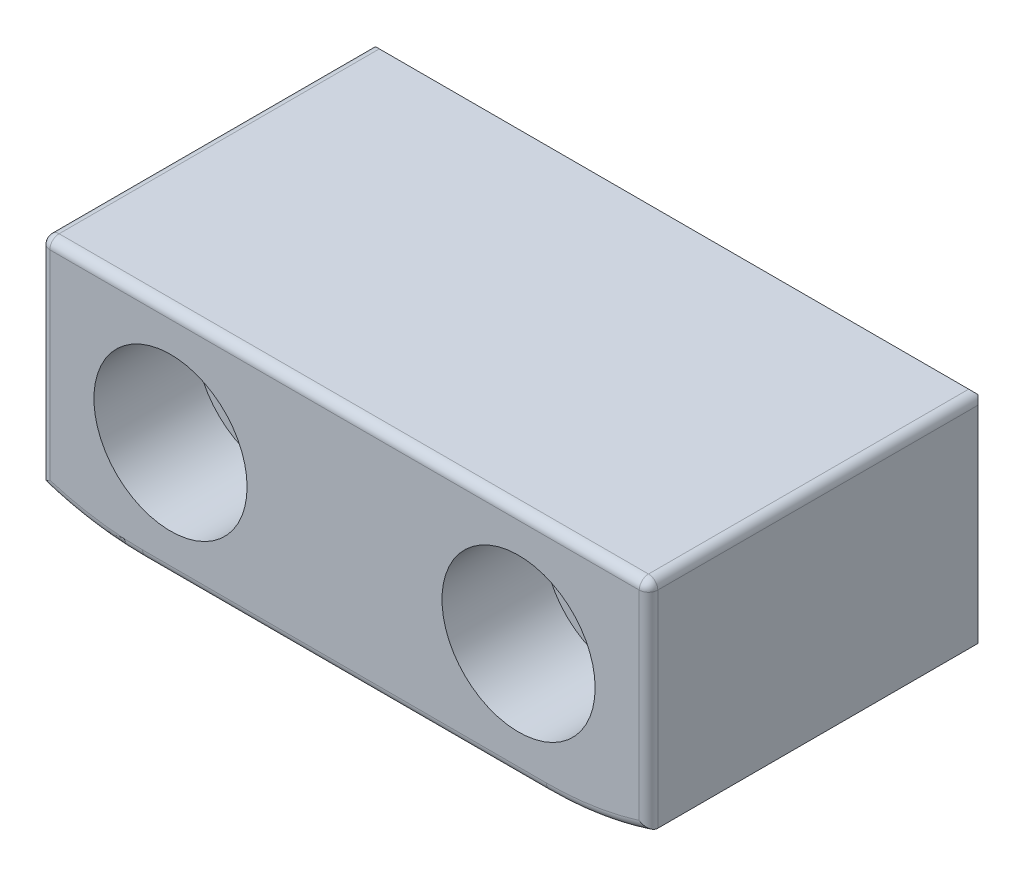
ISO-10303-21;
HEADER;
FILE_DESCRIPTION(('STEP AP214'),'2;1');
FILE_NAME('part.step','',(''),(''),'','','');
FILE_SCHEMA(('AUTOMOTIVE_DESIGN { 1 0 10303 214 1 1 1 1 }'));
ENDSEC;
DATA;
#1=APPLICATION_CONTEXT('core data for automotive mechanical design processes');
#2=APPLICATION_PROTOCOL_DEFINITION('international standard','automotive_design',2000,#1);
#3=PRODUCT_CONTEXT('',#1,'mechanical');
#4=PRODUCT('Part','Part','',(#3));
#5=PRODUCT_RELATED_PRODUCT_CATEGORY('part','',(#4));
#6=PRODUCT_DEFINITION_FORMATION('','',#4);
#7=PRODUCT_DEFINITION_CONTEXT('part definition',#1,'design');
#8=PRODUCT_DEFINITION('design','',#6,#7);
#9=PRODUCT_DEFINITION_SHAPE('','',#8);
#10=(LENGTH_UNIT() NAMED_UNIT(*) SI_UNIT(.MILLI.,.METRE.));
#11=(NAMED_UNIT(*) PLANE_ANGLE_UNIT() SI_UNIT($,.RADIAN.));
#12=(NAMED_UNIT(*) SI_UNIT($,.STERADIAN.) SOLID_ANGLE_UNIT());
#13=UNCERTAINTY_MEASURE_WITH_UNIT(LENGTH_MEASURE(1.E-05),#10,'distance_accuracy_value','');
#14=(GEOMETRIC_REPRESENTATION_CONTEXT(3) GLOBAL_UNCERTAINTY_ASSIGNED_CONTEXT((#13)) GLOBAL_UNIT_ASSIGNED_CONTEXT((#10,
#11,#12)) REPRESENTATION_CONTEXT('',''));
#15=CARTESIAN_POINT('',(0.,0.,0.));
#16=DIRECTION('',(0.,0.,1.));
#17=DIRECTION('',(1.,0.,0.));
#18=AXIS2_PLACEMENT_3D('',#15,#16,#17);
#19=CARTESIAN_POINT('',(-9.525,-6.35,-19.05));
#20=DIRECTION('',(0.,0.,1.));
#21=DIRECTION('',(1.,0.,0.));
#22=AXIS2_PLACEMENT_3D('',#19,#20,#21);
#23=CYLINDRICAL_SURFACE('',#22,2.794);
#24=CARTESIAN_POINT('',(-9.525,-6.35,-19.05));
#25=DIRECTION('',(0.,0.,1.));
#26=DIRECTION('',(1.,0.,0.));
#27=AXIS2_PLACEMENT_3D('',#24,#25,#26);
#28=CIRCLE('',#27,2.794);
#29=CARTESIAN_POINT('',(-6.731,-6.35,-19.05));
#30=VERTEX_POINT('',#29);
#31=EDGE_CURVE('E387',#30,#30,#28,.T.);
#32=CARTESIAN_POINT('',(-9.525,-6.35,-5.588));
#33=DIRECTION('',(0.,0.,1.));
#34=DIRECTION('',(1.,0.,0.));
#35=AXIS2_PLACEMENT_3D('',#32,#33,#34);
#36=CIRCLE('',#35,2.794);
#37=CARTESIAN_POINT('',(-6.731,-6.35,-5.588));
#38=VERTEX_POINT('',#37);
#39=EDGE_CURVE('E195',#38,#38,#36,.F.);
#40=CARTESIAN_POINT('',(-6.731,-6.35,-19.05));
#41=CARTESIAN_POINT('',(-6.731,-6.35,-18.9097708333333));
#42=CARTESIAN_POINT('',(-6.731,-6.35,-18.7695416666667));
#43=CARTESIAN_POINT('',(-6.731,-6.35,-18.4890833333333));
#44=CARTESIAN_POINT('',(-6.731,-6.35,-18.3488541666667));
#45=CARTESIAN_POINT('',(-6.731,-6.35,-18.0683958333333));
#46=CARTESIAN_POINT('',(-6.731,-6.35,-17.9281666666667));
#47=CARTESIAN_POINT('',(-6.731,-6.35,-17.6477083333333));
#48=CARTESIAN_POINT('',(-6.731,-6.35,-17.5074791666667));
#49=CARTESIAN_POINT('',(-6.731,-6.35,-17.2270208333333));
#50=CARTESIAN_POINT('',(-6.731,-6.35,-17.0867916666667));
#51=CARTESIAN_POINT('',(-6.731,-6.35,-16.8063333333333));
#52=CARTESIAN_POINT('',(-6.731,-6.35,-16.6661041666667));
#53=CARTESIAN_POINT('',(-6.731,-6.35,-16.3856458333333));
#54=CARTESIAN_POINT('',(-6.731,-6.35,-16.2454166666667));
#55=CARTESIAN_POINT('',(-6.731,-6.35,-15.9649583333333));
#56=CARTESIAN_POINT('',(-6.731,-6.35,-15.8247291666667));
#57=CARTESIAN_POINT('',(-6.731,-6.35,-15.5442708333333));
#58=CARTESIAN_POINT('',(-6.731,-6.35,-15.4040416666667));
#59=CARTESIAN_POINT('',(-6.731,-6.35,-15.1235833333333));
#60=CARTESIAN_POINT('',(-6.731,-6.35,-14.9833541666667));
#61=CARTESIAN_POINT('',(-6.731,-6.35,-14.7028958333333));
#62=CARTESIAN_POINT('',(-6.731,-6.35,-14.5626666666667));
#63=CARTESIAN_POINT('',(-6.731,-6.35,-14.2822083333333));
#64=CARTESIAN_POINT('',(-6.731,-6.35,-14.1419791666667));
#65=CARTESIAN_POINT('',(-6.731,-6.35,-13.8615208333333));
#66=CARTESIAN_POINT('',(-6.731,-6.35,-13.7212916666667));
#67=CARTESIAN_POINT('',(-6.731,-6.35,-13.4408333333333));
#68=CARTESIAN_POINT('',(-6.731,-6.35,-13.3006041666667));
#69=CARTESIAN_POINT('',(-6.731,-6.35,-13.0201458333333));
#70=CARTESIAN_POINT('',(-6.731,-6.35,-12.8799166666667));
#71=CARTESIAN_POINT('',(-6.731,-6.35,-12.5994583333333));
#72=CARTESIAN_POINT('',(-6.731,-6.35,-12.4592291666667));
#73=CARTESIAN_POINT('',(-6.731,-6.35,-12.1787708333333));
#74=CARTESIAN_POINT('',(-6.731,-6.35,-12.0385416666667));
#75=CARTESIAN_POINT('',(-6.731,-6.35,-11.7580833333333));
#76=CARTESIAN_POINT('',(-6.731,-6.35,-11.6178541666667));
#77=CARTESIAN_POINT('',(-6.731,-6.35,-11.3373958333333));
#78=CARTESIAN_POINT('',(-6.731,-6.35,-11.1971666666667));
#79=CARTESIAN_POINT('',(-6.731,-6.35,-10.9167083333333));
#80=CARTESIAN_POINT('',(-6.731,-6.35,-10.7764791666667));
#81=CARTESIAN_POINT('',(-6.731,-6.35,-10.4960208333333));
#82=CARTESIAN_POINT('',(-6.731,-6.35,-10.3557916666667));
#83=CARTESIAN_POINT('',(-6.731,-6.35,-10.0753333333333));
#84=CARTESIAN_POINT('',(-6.731,-6.35,-9.93510416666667));
#85=CARTESIAN_POINT('',(-6.731,-6.35,-9.65464583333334));
#86=CARTESIAN_POINT('',(-6.731,-6.35,-9.51441666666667));
#87=CARTESIAN_POINT('',(-6.731,-6.35,-9.23395833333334));
#88=CARTESIAN_POINT('',(-6.731,-6.35,-9.09372916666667));
#89=CARTESIAN_POINT('',(-6.731,-6.35,-8.81327083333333));
#90=CARTESIAN_POINT('',(-6.731,-6.35,-8.67304166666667));
#91=CARTESIAN_POINT('',(-6.731,-6.35,-8.39258333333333));
#92=CARTESIAN_POINT('',(-6.731,-6.35,-8.25235416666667));
#93=CARTESIAN_POINT('',(-6.731,-6.35,-7.97189583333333));
#94=CARTESIAN_POINT('',(-6.731,-6.35,-7.83166666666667));
#95=CARTESIAN_POINT('',(-6.731,-6.35,-7.55120833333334));
#96=CARTESIAN_POINT('',(-6.731,-6.35,-7.41097916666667));
#97=CARTESIAN_POINT('',(-6.731,-6.35,-7.13052083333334));
#98=CARTESIAN_POINT('',(-6.731,-6.35,-6.99029166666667));
#99=CARTESIAN_POINT('',(-6.731,-6.35,-6.70983333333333));
#100=CARTESIAN_POINT('',(-6.731,-6.35,-6.56960416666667));
#101=CARTESIAN_POINT('',(-6.731,-6.35,-6.28914583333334));
#102=CARTESIAN_POINT('',(-6.731,-6.35,-6.14891666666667));
#103=CARTESIAN_POINT('',(-6.731,-6.35,-5.86845833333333));
#104=CARTESIAN_POINT('',(-6.731,-6.35,-5.72822916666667));
#105=CARTESIAN_POINT('',(-6.731,-6.35,-5.588));
#106=B_SPLINE_CURVE_WITH_KNOTS('',3,(#40,#41,#42,#43,#44,#45,#46,#47,#48,#49,#50,#51,#52,#53,
#54,#55,#56,#57,#58,#59,#60,#61,#62,#63,#64,#65,#66,#67,#68,#69,#70,#71,#72,#73,#74,#75,#76,#77,
#78,#79,#80,#81,#82,#83,#84,#85,#86,#87,#88,#89,#90,#91,#92,#93,#94,#95,#96,#97,#98,#99,#100,
#101,#102,#103,#104,#105),.UNSPECIFIED.,.F.,.F.,(4,2,2,2,2,2,2,2,2,2,2,2,2,2,2,2,2,2,2,2,2,2,2,
2,2,2,2,2,2,2,2,2,4),(0.,0.420687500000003,0.841375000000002,1.2620625,1.68275,2.1034375,
2.524125,2.9448125,3.3655,3.7861875,4.206875,4.6275625,5.04825,5.4689375,5.889625,6.3103125,
6.731,7.1516875,7.572375,7.9930625,8.41375,8.8344375,9.255125,9.6758125,10.0965,10.5171875,
10.937875,11.3585625,11.77925,12.1999375,12.620625,13.0413125,13.462),.UNSPECIFIED.);
#107=EDGE_CURVE('BSEAM37',#30,#38,#106,.T.);
#108=ORIENTED_EDGE('',*,*,#31,.F.);
#109=ORIENTED_EDGE('',*,*,#39,.F.);
#110=ORIENTED_EDGE('',*,*,#107,.T.);
#111=ORIENTED_EDGE('',*,*,#107,.F.);
#112=EDGE_LOOP('',(#108,#110,#109,#111));
#113=FACE_BOUND('',#112,.T.);
#114=ADVANCED_FACE('F37',(#113),#23,.F.);
#115=CARTESIAN_POINT('',(9.525,-6.35,-19.05));
#116=DIRECTION('',(0.,0.,1.));
#117=DIRECTION('',(1.,0.,0.));
#118=AXIS2_PLACEMENT_3D('',#115,#116,#117);
#119=CYLINDRICAL_SURFACE('',#118,2.794);
#120=CARTESIAN_POINT('',(9.525,-6.35,-19.05));
#121=DIRECTION('',(0.,0.,1.));
#122=DIRECTION('',(1.,0.,0.));
#123=AXIS2_PLACEMENT_3D('',#120,#121,#122);
#124=CIRCLE('',#123,2.794);
#125=CARTESIAN_POINT('',(12.319,-6.35,-19.05));
#126=VERTEX_POINT('',#125);
#127=EDGE_CURVE('E384',#126,#126,#124,.T.);
#128=CARTESIAN_POINT('',(9.525,-6.35,-5.588));
#129=DIRECTION('',(0.,0.,1.));
#130=DIRECTION('',(1.,0.,0.));
#131=AXIS2_PLACEMENT_3D('',#128,#129,#130);
#132=CIRCLE('',#131,2.794);
#133=CARTESIAN_POINT('',(12.319,-6.35,-5.588));
#134=VERTEX_POINT('',#133);
#135=EDGE_CURVE('E385',#134,#134,#132,.F.);
#136=CARTESIAN_POINT('',(12.319,-6.35,-19.05));
#137=CARTESIAN_POINT('',(12.319,-6.35,-18.9097708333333));
#138=CARTESIAN_POINT('',(12.319,-6.35,-18.7695416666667));
#139=CARTESIAN_POINT('',(12.319,-6.35,-18.4890833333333));
#140=CARTESIAN_POINT('',(12.319,-6.35,-18.3488541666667));
#141=CARTESIAN_POINT('',(12.319,-6.35,-18.0683958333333));
#142=CARTESIAN_POINT('',(12.319,-6.35,-17.9281666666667));
#143=CARTESIAN_POINT('',(12.319,-6.35,-17.6477083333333));
#144=CARTESIAN_POINT('',(12.319,-6.35,-17.5074791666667));
#145=CARTESIAN_POINT('',(12.319,-6.35,-17.2270208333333));
#146=CARTESIAN_POINT('',(12.319,-6.35,-17.0867916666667));
#147=CARTESIAN_POINT('',(12.319,-6.35,-16.8063333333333));
#148=CARTESIAN_POINT('',(12.319,-6.35,-16.6661041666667));
#149=CARTESIAN_POINT('',(12.319,-6.35,-16.3856458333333));
#150=CARTESIAN_POINT('',(12.319,-6.35,-16.2454166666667));
#151=CARTESIAN_POINT('',(12.319,-6.35,-15.9649583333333));
#152=CARTESIAN_POINT('',(12.319,-6.35,-15.8247291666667));
#153=CARTESIAN_POINT('',(12.319,-6.35,-15.5442708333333));
#154=CARTESIAN_POINT('',(12.319,-6.35,-15.4040416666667));
#155=CARTESIAN_POINT('',(12.319,-6.35,-15.1235833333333));
#156=CARTESIAN_POINT('',(12.319,-6.35,-14.9833541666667));
#157=CARTESIAN_POINT('',(12.319,-6.35,-14.7028958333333));
#158=CARTESIAN_POINT('',(12.319,-6.35,-14.5626666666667));
#159=CARTESIAN_POINT('',(12.319,-6.35,-14.2822083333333));
#160=CARTESIAN_POINT('',(12.319,-6.35,-14.1419791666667));
#161=CARTESIAN_POINT('',(12.319,-6.35,-13.8615208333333));
#162=CARTESIAN_POINT('',(12.319,-6.35,-13.7212916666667));
#163=CARTESIAN_POINT('',(12.319,-6.35,-13.4408333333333));
#164=CARTESIAN_POINT('',(12.319,-6.35,-13.3006041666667));
#165=CARTESIAN_POINT('',(12.319,-6.35,-13.0201458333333));
#166=CARTESIAN_POINT('',(12.319,-6.35,-12.8799166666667));
#167=CARTESIAN_POINT('',(12.319,-6.35,-12.5994583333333));
#168=CARTESIAN_POINT('',(12.319,-6.35,-12.4592291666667));
#169=CARTESIAN_POINT('',(12.319,-6.35,-12.1787708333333));
#170=CARTESIAN_POINT('',(12.319,-6.35,-12.0385416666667));
#171=CARTESIAN_POINT('',(12.319,-6.35,-11.7580833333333));
#172=CARTESIAN_POINT('',(12.319,-6.35,-11.6178541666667));
#173=CARTESIAN_POINT('',(12.319,-6.35,-11.3373958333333));
#174=CARTESIAN_POINT('',(12.319,-6.35,-11.1971666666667));
#175=CARTESIAN_POINT('',(12.319,-6.35,-10.9167083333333));
#176=CARTESIAN_POINT('',(12.319,-6.35,-10.7764791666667));
#177=CARTESIAN_POINT('',(12.319,-6.35,-10.4960208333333));
#178=CARTESIAN_POINT('',(12.319,-6.35,-10.3557916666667));
#179=CARTESIAN_POINT('',(12.319,-6.35,-10.0753333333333));
#180=CARTESIAN_POINT('',(12.319,-6.35,-9.93510416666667));
#181=CARTESIAN_POINT('',(12.319,-6.35,-9.65464583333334));
#182=CARTESIAN_POINT('',(12.319,-6.35,-9.51441666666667));
#183=CARTESIAN_POINT('',(12.319,-6.35,-9.23395833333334));
#184=CARTESIAN_POINT('',(12.319,-6.35,-9.09372916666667));
#185=CARTESIAN_POINT('',(12.319,-6.35,-8.81327083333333));
#186=CARTESIAN_POINT('',(12.319,-6.35,-8.67304166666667));
#187=CARTESIAN_POINT('',(12.319,-6.35,-8.39258333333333));
#188=CARTESIAN_POINT('',(12.319,-6.35,-8.25235416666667));
#189=CARTESIAN_POINT('',(12.319,-6.35,-7.97189583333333));
#190=CARTESIAN_POINT('',(12.319,-6.35,-7.83166666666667));
#191=CARTESIAN_POINT('',(12.319,-6.35,-7.55120833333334));
#192=CARTESIAN_POINT('',(12.319,-6.35,-7.41097916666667));
#193=CARTESIAN_POINT('',(12.319,-6.35,-7.13052083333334));
#194=CARTESIAN_POINT('',(12.319,-6.35,-6.99029166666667));
#195=CARTESIAN_POINT('',(12.319,-6.35,-6.70983333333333));
#196=CARTESIAN_POINT('',(12.319,-6.35,-6.56960416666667));
#197=CARTESIAN_POINT('',(12.319,-6.35,-6.28914583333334));
#198=CARTESIAN_POINT('',(12.319,-6.35,-6.14891666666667));
#199=CARTESIAN_POINT('',(12.319,-6.35,-5.86845833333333));
#200=CARTESIAN_POINT('',(12.319,-6.35,-5.72822916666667));
#201=CARTESIAN_POINT('',(12.319,-6.35,-5.588));
#202=B_SPLINE_CURVE_WITH_KNOTS('',3,(#136,#137,#138,#139,#140,#141,#142,#143,#144,#145,#146,
#147,#148,#149,#150,#151,#152,#153,#154,#155,#156,#157,#158,#159,#160,#161,#162,#163,#164,#165,
#166,#167,#168,#169,#170,#171,#172,#173,#174,#175,#176,#177,#178,#179,#180,#181,#182,#183,#184,
#185,#186,#187,#188,#189,#190,#191,#192,#193,#194,#195,#196,#197,#198,#199,#200,#201),
.UNSPECIFIED.,.F.,.F.,(4,2,2,2,2,2,2,2,2,2,2,2,2,2,2,2,2,2,2,2,2,2,2,2,2,2,2,2,2,2,2,2,4),(0.,
0.420687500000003,0.841375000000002,1.2620625,1.68275,2.1034375,2.524125,2.9448125,3.3655,
3.7861875,4.206875,4.6275625,5.04825,5.4689375,5.889625,6.3103125,6.731,7.1516875,7.572375,
7.9930625,8.41375,8.8344375,9.255125,9.6758125,10.0965,10.5171875,10.937875,11.3585625,11.77925,
12.1999375,12.620625,13.0413125,13.462),.UNSPECIFIED.);
#203=EDGE_CURVE('BSEAM407',#126,#134,#202,.T.);
#204=ORIENTED_EDGE('',*,*,#127,.F.);
#205=ORIENTED_EDGE('',*,*,#135,.F.);
#206=ORIENTED_EDGE('',*,*,#203,.T.);
#207=ORIENTED_EDGE('',*,*,#203,.F.);
#208=EDGE_LOOP('',(#204,#206,#205,#207));
#209=FACE_BOUND('',#208,.T.);
#210=ADVANCED_FACE('F407',(#209),#119,.F.);
#211=CARTESIAN_POINT('',(-11.049,5.08,-19.05));
#212=DIRECTION('',(0.,0.,1.));
#213=DIRECTION('',(1.,0.,0.));
#214=AXIS2_PLACEMENT_3D('',#211,#212,#213);
#215=CYLINDRICAL_SURFACE('',#214,17.78);
#216=DIRECTION('',(0.,0.,1.));
#217=VECTOR('',#216,1.);
#218=CARTESIAN_POINT('',(-11.049,-12.7,-19.05));
#219=LINE('',#218,#217);
#220=CARTESIAN_POINT('',(-11.049,-12.7,-18.034));
#221=VERTEX_POINT('',#220);
#222=CARTESIAN_POINT('',(-11.049,-12.7,-0.508000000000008));
#223=VERTEX_POINT('',#222);
#224=EDGE_CURVE('E155',#221,#223,#219,.T.);
#225=ORIENTED_EDGE('',*,*,#224,.T.);
#226=CARTESIAN_POINT('',(-11.049,5.08,-0.508000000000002));
#227=DIRECTION('',(0.,0.,-1.));
#228=DIRECTION('',(-1.,0.,0.));
#229=AXIS2_PLACEMENT_3D('',#226,#227,#228);
#230=CIRCLE('',#229,17.78);
#231=CARTESIAN_POINT('',(-16.637,-11.7990596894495,-0.508000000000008));
#232=VERTEX_POINT('',#231);
#233=EDGE_CURVE('E265',#223,#232,#230,.T.);
#234=ORIENTED_EDGE('',*,*,#233,.T.);
#235=DIRECTION('',(0.,0.,1.));
#236=VECTOR('',#235,1.);
#237=CARTESIAN_POINT('',(-16.637,-11.7990596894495,-19.05));
#238=LINE('',#237,#236);
#239=CARTESIAN_POINT('',(-16.637,-11.7990596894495,-18.034));
#240=VERTEX_POINT('',#239);
#241=EDGE_CURVE('E188',#240,#232,#238,.T.);
#242=ORIENTED_EDGE('',*,*,#241,.F.);
#243=CARTESIAN_POINT('',(-11.049,5.08,-18.034));
#244=DIRECTION('',(0.,0.,-1.));
#245=DIRECTION('',(-1.,0.,0.));
#246=AXIS2_PLACEMENT_3D('',#243,#244,#245);
#247=CIRCLE('',#246,17.78);
#248=EDGE_CURVE('E207',#240,#221,#247,.F.);
#249=ORIENTED_EDGE('',*,*,#248,.T.);
#250=EDGE_LOOP('',(#225,#234,#242,#249));
#251=FACE_BOUND('',#250,.T.);
#252=ADVANCED_FACE('F410',(#251),#215,.T.);
#253=CARTESIAN_POINT('',(-16.637,-11.7990596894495,-19.05));
#254=DIRECTION('',(-1.,0.,0.));
#255=DIRECTION('',(0.,0.,1.));
#256=AXIS2_PLACEMENT_3D('',#253,#254,#255);
#257=PLANE('',#256);
#258=ORIENTED_EDGE('',*,*,#241,.T.);
#259=DIRECTION('',(0.,-1.,0.));
#260=VECTOR('',#259,1.);
#261=CARTESIAN_POINT('',(-16.637,0.,-0.508));
#262=LINE('',#261,#260);
#263=CARTESIAN_POINT('',(-16.637,-0.508,-0.508));
#264=VERTEX_POINT('',#263);
#265=EDGE_CURVE('E271',#232,#264,#262,.F.);
#266=ORIENTED_EDGE('',*,*,#265,.T.);
#267=DIRECTION('',(0.,0.,1.));
#268=VECTOR('',#267,1.);
#269=CARTESIAN_POINT('',(-16.637,-0.508,-19.05));
#270=LINE('',#269,#268);
#271=CARTESIAN_POINT('',(-16.637,-0.508,-18.034));
#272=VERTEX_POINT('',#271);
#273=EDGE_CURVE('E269',#264,#272,#270,.F.);
#274=ORIENTED_EDGE('',*,*,#273,.T.);
#275=DIRECTION('',(0.,-1.,0.));
#276=VECTOR('',#275,1.);
#277=CARTESIAN_POINT('',(-16.637,-11.7990596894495,-18.034));
#278=LINE('',#277,#276);
#279=EDGE_CURVE('E209',#272,#240,#278,.T.);
#280=ORIENTED_EDGE('',*,*,#279,.T.);
#281=EDGE_LOOP('',(#258,#266,#274,#280));
#282=FACE_BOUND('',#281,.T.);
#283=ADVANCED_FACE('F416',(#282),#257,.T.);
#284=CARTESIAN_POINT('',(-16.637,0.,-19.05));
#285=DIRECTION('',(0.,1.,0.));
#286=DIRECTION('',(-1.,0.,0.));
#287=AXIS2_PLACEMENT_3D('',#284,#285,#286);
#288=PLANE('',#287);
#289=DIRECTION('',(-1.,0.,0.));
#290=VECTOR('',#289,1.);
#291=CARTESIAN_POINT('',(16.637,0.,-0.508));
#292=LINE('',#291,#290);
#293=CARTESIAN_POINT('',(-16.129,0.,-0.508));
#294=VERTEX_POINT('',#293);
#295=CARTESIAN_POINT('',(16.129,0.,-0.508));
#296=VERTEX_POINT('',#295);
#297=EDGE_CURVE('E279',#294,#296,#292,.F.);
#298=ORIENTED_EDGE('',*,*,#297,.T.);
#299=DIRECTION('',(0.,0.,1.));
#300=VECTOR('',#299,1.);
#301=CARTESIAN_POINT('',(16.129,0.,-19.05));
#302=LINE('',#301,#300);
#303=CARTESIAN_POINT('',(16.129,0.,-18.034));
#304=VERTEX_POINT('',#303);
#305=EDGE_CURVE('E283',#296,#304,#302,.F.);
#306=ORIENTED_EDGE('',*,*,#305,.T.);
#307=DIRECTION('',(-1.,0.,0.));
#308=VECTOR('',#307,1.);
#309=CARTESIAN_POINT('',(-16.637,0.,-18.034));
#310=LINE('',#309,#308);
#311=CARTESIAN_POINT('',(-16.129,0.,-18.034));
#312=VERTEX_POINT('',#311);
#313=EDGE_CURVE('E211',#304,#312,#310,.T.);
#314=ORIENTED_EDGE('',*,*,#313,.T.);
#315=DIRECTION('',(0.,0.,1.));
#316=VECTOR('',#315,1.);
#317=CARTESIAN_POINT('',(-16.129,0.,-19.05));
#318=LINE('',#317,#316);
#319=EDGE_CURVE('E281',#312,#294,#318,.T.);
#320=ORIENTED_EDGE('',*,*,#319,.T.);
#321=EDGE_LOOP('',(#298,#306,#314,#320));
#322=FACE_BOUND('',#321,.T.);
#323=ADVANCED_FACE('F354',(#322),#288,.T.);
#324=CARTESIAN_POINT('',(16.637,-11.7990596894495,-19.05));
#325=DIRECTION('',(1.,0.,0.));
#326=DIRECTION('',(0.,1.,0.));
#327=AXIS2_PLACEMENT_3D('',#324,#325,#326);
#328=PLANE('',#327);
#329=DIRECTION('',(0.,1.,0.));
#330=VECTOR('',#329,1.);
#331=CARTESIAN_POINT('',(16.637,-11.7990596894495,-18.034));
#332=LINE('',#331,#330);
#333=CARTESIAN_POINT('',(16.637,-11.7990596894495,-18.034));
#334=VERTEX_POINT('',#333);
#335=CARTESIAN_POINT('',(16.637,-0.507999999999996,-18.034));
#336=VERTEX_POINT('',#335);
#337=EDGE_CURVE('E160',#334,#336,#332,.T.);
#338=ORIENTED_EDGE('',*,*,#337,.T.);
#339=DIRECTION('',(0.,0.,1.));
#340=VECTOR('',#339,1.);
#341=CARTESIAN_POINT('',(16.637,-0.507999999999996,-19.05));
#342=LINE('',#341,#340);
#343=CARTESIAN_POINT('',(16.637,-0.507999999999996,-0.508));
#344=VERTEX_POINT('',#343);
#345=EDGE_CURVE('E277',#336,#344,#342,.T.);
#346=ORIENTED_EDGE('',*,*,#345,.T.);
#347=DIRECTION('',(0.,1.,0.));
#348=VECTOR('',#347,1.);
#349=CARTESIAN_POINT('',(16.637,-11.7990596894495,-0.508));
#350=LINE('',#349,#348);
#351=CARTESIAN_POINT('',(16.637,-11.7990596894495,-0.508000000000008));
#352=VERTEX_POINT('',#351);
#353=EDGE_CURVE('E275',#344,#352,#350,.F.);
#354=ORIENTED_EDGE('',*,*,#353,.T.);
#355=DIRECTION('',(0.,0.,1.));
#356=VECTOR('',#355,1.);
#357=CARTESIAN_POINT('',(16.637,-11.7990596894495,-19.05));
#358=LINE('',#357,#356);
#359=EDGE_CURVE('E172',#334,#352,#358,.T.);
#360=ORIENTED_EDGE('',*,*,#359,.F.);
#361=EDGE_LOOP('',(#338,#346,#354,#360));
#362=FACE_BOUND('',#361,.T.);
#363=ADVANCED_FACE('F380',(#362),#328,.T.);
#364=CARTESIAN_POINT('',(11.049,5.08,-19.05));
#365=DIRECTION('',(0.,0.,1.));
#366=DIRECTION('',(1.,0.,0.));
#367=AXIS2_PLACEMENT_3D('',#364,#365,#366);
#368=CYLINDRICAL_SURFACE('',#367,17.78);
#369=ORIENTED_EDGE('',*,*,#359,.T.);
#370=CARTESIAN_POINT('',(11.049,5.08,-0.508000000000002));
#371=DIRECTION('',(0.,0.,-1.));
#372=DIRECTION('',(-1.,0.,0.));
#373=AXIS2_PLACEMENT_3D('',#370,#371,#372);
#374=CIRCLE('',#373,17.78);
#375=CARTESIAN_POINT('',(11.049,-12.7,-0.508000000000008));
#376=VERTEX_POINT('',#375);
#377=EDGE_CURVE('E171',#352,#376,#374,.T.);
#378=ORIENTED_EDGE('',*,*,#377,.T.);
#379=DIRECTION('',(0.,0.,1.));
#380=VECTOR('',#379,1.);
#381=CARTESIAN_POINT('',(11.049,-12.7,-19.05));
#382=LINE('',#381,#380);
#383=CARTESIAN_POINT('',(11.049,-12.7,-18.034));
#384=VERTEX_POINT('',#383);
#385=EDGE_CURVE('E152',#384,#376,#382,.T.);
#386=ORIENTED_EDGE('',*,*,#385,.F.);
#387=CARTESIAN_POINT('',(11.049,5.08,-18.034));
#388=DIRECTION('',(0.,0.,-1.));
#389=DIRECTION('',(-1.,0.,0.));
#390=AXIS2_PLACEMENT_3D('',#387,#388,#389);
#391=CIRCLE('',#390,17.78);
#392=EDGE_CURVE('E168',#384,#334,#391,.F.);
#393=ORIENTED_EDGE('',*,*,#392,.T.);
#394=EDGE_LOOP('',(#369,#378,#386,#393));
#395=FACE_BOUND('',#394,.T.);
#396=ADVANCED_FACE('F166',(#395),#368,.T.);
#397=CARTESIAN_POINT('',(-11.049,-12.7,-19.05));
#398=DIRECTION('',(0.,-1.,0.));
#399=DIRECTION('',(1.,0.,0.));
#400=AXIS2_PLACEMENT_3D('',#397,#398,#399);
#401=PLANE('',#400);
#402=ORIENTED_EDGE('',*,*,#385,.T.);
#403=DIRECTION('',(1.,0.,0.));
#404=VECTOR('',#403,1.);
#405=CARTESIAN_POINT('',(-11.049,-12.7,-0.508));
#406=LINE('',#405,#404);
#407=EDGE_CURVE('E273',#376,#223,#406,.F.);
#408=ORIENTED_EDGE('',*,*,#407,.T.);
#409=ORIENTED_EDGE('',*,*,#224,.F.);
#410=DIRECTION('',(1.,0.,0.));
#411=VECTOR('',#410,1.);
#412=CARTESIAN_POINT('',(-11.049,-12.7,-18.034));
#413=LINE('',#412,#411);
#414=EDGE_CURVE('E149',#221,#384,#413,.T.);
#415=ORIENTED_EDGE('',*,*,#414,.T.);
#416=EDGE_LOOP('',(#402,#408,#409,#415));
#417=FACE_BOUND('',#416,.T.);
#418=ADVANCED_FACE('F151',(#417),#401,.T.);
#419=CARTESIAN_POINT('',(-11.049,5.08,-19.05));
#420=DIRECTION('',(0.,0.,-1.));
#421=DIRECTION('',(-1.,0.,0.));
#422=AXIS2_PLACEMENT_3D('',#419,#420,#421);
#423=PLANE('',#422);
#424=DIRECTION('',(0.,-1.,0.));
#425=VECTOR('',#424,1.);
#426=CARTESIAN_POINT('',(15.621,5.08000000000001,-19.05));
#427=LINE('',#426,#425);
#428=CARTESIAN_POINT('',(15.621,-1.016,-19.05));
#429=VERTEX_POINT('',#428);
#430=CARTESIAN_POINT('',(15.621,-11.0484999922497,-19.05));
#431=VERTEX_POINT('',#430);
#432=EDGE_CURVE('E201',#429,#431,#427,.T.);
#433=ORIENTED_EDGE('',*,*,#432,.T.);
#434=CARTESIAN_POINT('',(11.049,5.08,-19.05));
#435=DIRECTION('',(0.,0.,-1.));
#436=DIRECTION('',(-1.,0.,0.));
#437=AXIS2_PLACEMENT_3D('',#434,#435,#436);
#438=CIRCLE('',#437,16.764);
#439=CARTESIAN_POINT('',(11.049,-11.684,-19.05));
#440=VERTEX_POINT('',#439);
#441=EDGE_CURVE('E161',#431,#440,#438,.T.);
#442=ORIENTED_EDGE('',*,*,#441,.T.);
#443=DIRECTION('',(-1.,0.,0.));
#444=VECTOR('',#443,1.);
#445=CARTESIAN_POINT('',(-11.049,-11.684,-19.05));
#446=LINE('',#445,#444);
#447=CARTESIAN_POINT('',(-11.049,-11.684,-19.05));
#448=VERTEX_POINT('',#447);
#449=EDGE_CURVE('E177',#440,#448,#446,.T.);
#450=ORIENTED_EDGE('',*,*,#449,.T.);
#451=CARTESIAN_POINT('',(-11.049,5.08,-19.05));
#452=DIRECTION('',(0.,0.,-1.));
#453=DIRECTION('',(-1.,0.,0.));
#454=AXIS2_PLACEMENT_3D('',#451,#452,#453);
#455=CIRCLE('',#454,16.764);
#456=CARTESIAN_POINT('',(-15.621,-11.0484999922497,-19.05));
#457=VERTEX_POINT('',#456);
#458=EDGE_CURVE('E199',#448,#457,#455,.T.);
#459=ORIENTED_EDGE('',*,*,#458,.T.);
#460=DIRECTION('',(0.,1.,0.));
#461=VECTOR('',#460,1.);
#462=CARTESIAN_POINT('',(-15.621,5.08,-19.05));
#463=LINE('',#462,#461);
#464=CARTESIAN_POINT('',(-15.621,-1.016,-19.05));
#465=VERTEX_POINT('',#464);
#466=EDGE_CURVE('E190',#457,#465,#463,.T.);
#467=ORIENTED_EDGE('',*,*,#466,.T.);
#468=DIRECTION('',(1.,0.,0.));
#469=VECTOR('',#468,1.);
#470=CARTESIAN_POINT('',(-11.049,-1.016,-19.05));
#471=LINE('',#470,#469);
#472=EDGE_CURVE('E187',#465,#429,#471,.T.);
#473=ORIENTED_EDGE('',*,*,#472,.T.);
#474=EDGE_LOOP('',(#433,#442,#450,#459,#467,#473));
#475=FACE_BOUND('',#474,.T.);
#476=ORIENTED_EDGE('',*,*,#31,.T.);
#477=EDGE_LOOP('',(#476));
#478=FACE_BOUND('',#477,.T.);
#479=ORIENTED_EDGE('',*,*,#127,.T.);
#480=EDGE_LOOP('',(#479));
#481=FACE_BOUND('',#480,.T.);
#482=ADVANCED_FACE('F405',(#475,#478,#481),#423,.T.);
#483=CARTESIAN_POINT('',(-11.049,5.08,0.));
#484=DIRECTION('',(0.,0.,-1.));
#485=DIRECTION('',(-1.,0.,0.));
#486=AXIS2_PLACEMENT_3D('',#483,#484,#485);
#487=PLANE('',#486);
#488=CARTESIAN_POINT('',(-11.049,5.08,0.));
#489=DIRECTION('',(0.,0.,-1.));
#490=DIRECTION('',(-1.,0.,0.));
#491=AXIS2_PLACEMENT_3D('',#488,#489,#490);
#492=CIRCLE('',#491,17.272);
#493=CARTESIAN_POINT('',(-16.129,-11.4280460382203,0.));
#494=VERTEX_POINT('',#493);
#495=CARTESIAN_POINT('',(-11.049,-12.192,0.));
#496=VERTEX_POINT('',#495);
#497=EDGE_CURVE('E260',#494,#496,#492,.F.);
#498=ORIENTED_EDGE('',*,*,#497,.T.);
#499=DIRECTION('',(1.,0.,0.));
#500=VECTOR('',#499,1.);
#501=CARTESIAN_POINT('',(11.049,-12.192,0.));
#502=LINE('',#501,#500);
#503=CARTESIAN_POINT('',(11.049,-12.192,0.));
#504=VERTEX_POINT('',#503);
#505=EDGE_CURVE('E263',#496,#504,#502,.T.);
#506=ORIENTED_EDGE('',*,*,#505,.T.);
#507=CARTESIAN_POINT('',(11.049,5.08,0.));
#508=DIRECTION('',(0.,0.,-1.));
#509=DIRECTION('',(-1.,0.,0.));
#510=AXIS2_PLACEMENT_3D('',#507,#508,#509);
#511=CIRCLE('',#510,17.272);
#512=CARTESIAN_POINT('',(16.129,-11.4280460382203,0.));
#513=VERTEX_POINT('',#512);
#514=EDGE_CURVE('E258',#504,#513,#511,.F.);
#515=ORIENTED_EDGE('',*,*,#514,.T.);
#516=DIRECTION('',(0.,1.,0.));
#517=VECTOR('',#516,1.);
#518=CARTESIAN_POINT('',(16.129,0.,0.));
#519=LINE('',#518,#517);
#520=CARTESIAN_POINT('',(16.129,-0.507999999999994,0.));
#521=VERTEX_POINT('',#520);
#522=EDGE_CURVE('E254',#513,#521,#519,.T.);
#523=ORIENTED_EDGE('',*,*,#522,.T.);
#524=DIRECTION('',(-1.,0.,0.));
#525=VECTOR('',#524,1.);
#526=CARTESIAN_POINT('',(-16.637,-0.508,0.));
#527=LINE('',#526,#525);
#528=CARTESIAN_POINT('',(-16.129,-0.508,0.));
#529=VERTEX_POINT('',#528);
#530=EDGE_CURVE('E214',#521,#529,#527,.T.);
#531=ORIENTED_EDGE('',*,*,#530,.T.);
#532=DIRECTION('',(0.,-1.,0.));
#533=VECTOR('',#532,1.);
#534=CARTESIAN_POINT('',(-16.129,-11.7990596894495,0.));
#535=LINE('',#534,#533);
#536=EDGE_CURVE('E256',#529,#494,#535,.T.);
#537=ORIENTED_EDGE('',*,*,#536,.T.);
#538=EDGE_LOOP('',(#498,#506,#515,#523,#531,#537));
#539=FACE_BOUND('',#538,.T.);
#540=CARTESIAN_POINT('',(-9.525,-6.35,0.));
#541=DIRECTION('',(0.,0.,1.));
#542=DIRECTION('',(1.,0.,0.));
#543=AXIS2_PLACEMENT_3D('',#540,#541,#542);
#544=CIRCLE('',#543,4.191);
#545=CARTESIAN_POINT('',(-5.334,-6.35,0.));
#546=VERTEX_POINT('',#545);
#547=EDGE_CURVE('E250',#546,#546,#544,.T.);
#548=ORIENTED_EDGE('',*,*,#547,.F.);
#549=EDGE_LOOP('',(#548));
#550=FACE_BOUND('',#549,.T.);
#551=CARTESIAN_POINT('',(9.525,-6.35,0.));
#552=DIRECTION('',(0.,0.,1.));
#553=DIRECTION('',(1.,0.,0.));
#554=AXIS2_PLACEMENT_3D('',#551,#552,#553);
#555=CIRCLE('',#554,4.191);
#556=CARTESIAN_POINT('',(13.716,-6.35,0.));
#557=VERTEX_POINT('',#556);
#558=EDGE_CURVE('E394',#557,#557,#555,.T.);
#559=ORIENTED_EDGE('',*,*,#558,.F.);
#560=EDGE_LOOP('',(#559));
#561=FACE_BOUND('',#560,.T.);
#562=ADVANCED_FACE('F373',(#539,#550,#561),#487,.F.);
#563=CARTESIAN_POINT('',(9.525,-6.35,-5.588));
#564=DIRECTION('',(0.,0.,1.));
#565=DIRECTION('',(1.,0.,0.));
#566=AXIS2_PLACEMENT_3D('',#563,#564,#565);
#567=PLANE('',#566);
#568=CARTESIAN_POINT('',(9.525,-6.35,-5.588));
#569=DIRECTION('',(0.,0.,1.));
#570=DIRECTION('',(1.,0.,0.));
#571=AXIS2_PLACEMENT_3D('',#568,#569,#570);
#572=CIRCLE('',#571,4.191);
#573=CARTESIAN_POINT('',(13.716,-6.35,-5.588));
#574=VERTEX_POINT('',#573);
#575=EDGE_CURVE('E388',#574,#574,#572,.T.);
#576=ORIENTED_EDGE('',*,*,#575,.T.);
#577=EDGE_LOOP('',(#576));
#578=FACE_BOUND('',#577,.T.);
#579=ORIENTED_EDGE('',*,*,#135,.T.);
#580=EDGE_LOOP('',(#579));
#581=FACE_BOUND('',#580,.T.);
#582=ADVANCED_FACE('F427',(#578,#581),#567,.T.);
#583=CARTESIAN_POINT('',(9.525,-6.35,-5.588));
#584=DIRECTION('',(0.,0.,1.));
#585=DIRECTION('',(1.,0.,0.));
#586=AXIS2_PLACEMENT_3D('',#583,#584,#585);
#587=CYLINDRICAL_SURFACE('',#586,4.191);
#588=ORIENTED_EDGE('',*,*,#575,.F.);
#589=EDGE_LOOP('',(#588));
#590=FACE_BOUND('',#589,.T.);
#591=ORIENTED_EDGE('',*,*,#558,.T.);
#592=EDGE_LOOP('',(#591));
#593=FACE_BOUND('',#592,.T.);
#594=ADVANCED_FACE('F459',(#590,#593),#587,.F.);
#595=CARTESIAN_POINT('',(-9.525,-6.35,-5.588));
#596=DIRECTION('',(0.,0.,1.));
#597=DIRECTION('',(1.,0.,0.));
#598=AXIS2_PLACEMENT_3D('',#595,#596,#597);
#599=PLANE('',#598);
#600=CARTESIAN_POINT('',(-9.525,-6.35,-5.588));
#601=DIRECTION('',(0.,0.,1.));
#602=DIRECTION('',(1.,0.,0.));
#603=AXIS2_PLACEMENT_3D('',#600,#601,#602);
#604=CIRCLE('',#603,4.191);
#605=CARTESIAN_POINT('',(-5.334,-6.35,-5.588));
#606=VERTEX_POINT('',#605);
#607=EDGE_CURVE('E719',#606,#606,#604,.T.);
#608=ORIENTED_EDGE('',*,*,#607,.T.);
#609=EDGE_LOOP('',(#608));
#610=FACE_BOUND('',#609,.T.);
#611=ORIENTED_EDGE('',*,*,#39,.T.);
#612=EDGE_LOOP('',(#611));
#613=FACE_BOUND('',#612,.T.);
#614=ADVANCED_FACE('F466',(#610,#613),#599,.T.);
#615=CARTESIAN_POINT('',(-9.525,-6.35,-5.588));
#616=DIRECTION('',(0.,0.,1.));
#617=DIRECTION('',(1.,0.,0.));
#618=AXIS2_PLACEMENT_3D('',#615,#616,#617);
#619=CYLINDRICAL_SURFACE('',#618,4.191);
#620=ORIENTED_EDGE('',*,*,#607,.F.);
#621=EDGE_LOOP('',(#620));
#622=FACE_BOUND('',#621,.T.);
#623=ORIENTED_EDGE('',*,*,#547,.T.);
#624=EDGE_LOOP('',(#623));
#625=FACE_BOUND('',#624,.T.);
#626=ADVANCED_FACE('F238',(#622,#625),#619,.F.);
#627=CARTESIAN_POINT('',(-16.637,-11.7990596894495,-18.034));
#628=DIRECTION('',(0.707106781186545,0.,0.70710678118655));
#629=DIRECTION('',(0.70710678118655,0.,-0.707106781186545));
#630=AXIS2_PLACEMENT_3D('',#627,#628,#629);
#631=PLANE('',#630);
#632=ORIENTED_EDGE('',*,*,#279,.F.);
#633=CARTESIAN_POINT('',(-16.129,-0.508,-18.542));
#634=DIRECTION('',(0.707106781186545,0.,0.70710678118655));
#635=DIRECTION('',(-0.70710678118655,0.,0.707106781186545));
#636=AXIS2_PLACEMENT_3D('',#633,#634,#635);
#637=ELLIPSE('',#636,0.71842048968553,0.508);
#638=CARTESIAN_POINT('',(-16.4882102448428,-0.148789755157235,-18.1827897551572));
#639=VERTEX_POINT('',#638);
#640=EDGE_CURVE('E11',#272,#639,#637,.F.);
#641=ORIENTED_EDGE('',*,*,#640,.T.);
#642=DIRECTION('',(-0.577350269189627,0.577350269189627,0.577350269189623));
#643=VECTOR('',#642,1.);
#644=CARTESIAN_POINT('',(-16.637,0.,-18.034));
#645=LINE('',#644,#643);
#646=EDGE_CURVE('E251',#465,#639,#645,.T.);
#647=ORIENTED_EDGE('',*,*,#646,.F.);
#648=ORIENTED_EDGE('',*,*,#466,.F.);
#649=CARTESIAN_POINT('',(-15.621,-11.0484999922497,-19.05));
#650=CARTESIAN_POINT('',(-15.7895080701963,-11.1758278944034,-18.8814919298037));
#651=CARTESIAN_POINT('',(-15.9584288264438,-11.3020385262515,-18.7125711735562));
#652=CARTESIAN_POINT('',(-16.2970954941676,-11.5522250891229,-18.3739045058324));
#653=CARTESIAN_POINT('',(-16.4668414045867,-11.6762010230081,-18.2041585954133));
#654=CARTESIAN_POINT('',(-16.637,-11.7990596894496,-18.034));
#655=B_SPLINE_CURVE_WITH_KNOTS('',3,(#649,#650,#651,#652,#653,#654),.UNSPECIFIED.,.F.,.F.,(4,2,
4),(0.,0.810541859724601,1.62108268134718),.UNSPECIFIED.);
#656=EDGE_CURVE('E242',#240,#457,#655,.F.);
#657=ORIENTED_EDGE('',*,*,#656,.F.);
#658=EDGE_LOOP('',(#632,#641,#647,#648,#657));
#659=FACE_BOUND('',#658,.T.);
#660=ADVANCED_FACE('F234',(#659),#631,.F.);
#661=CARTESIAN_POINT('',(-11.049,5.08,-18.034));
#662=DIRECTION('',(0.,0.,1.));
#663=DIRECTION('',(1.,0.,0.));
#664=AXIS2_PLACEMENT_3D('',#661,#662,#663);
#665=CONICAL_SURFACE('',#664,17.78,0.785398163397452);
#666=ORIENTED_EDGE('',*,*,#656,.T.);
#667=ORIENTED_EDGE('',*,*,#458,.F.);
#668=DIRECTION('',(0.,0.70710678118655,-0.707106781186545));
#669=VECTOR('',#668,1.);
#670=CARTESIAN_POINT('',(-11.049,-12.7,-18.034));
#671=LINE('',#670,#669);
#672=EDGE_CURVE('E702',#221,#448,#671,.T.);
#673=ORIENTED_EDGE('',*,*,#672,.F.);
#674=ORIENTED_EDGE('',*,*,#248,.F.);
#675=EDGE_LOOP('',(#666,#667,#673,#674));
#676=FACE_BOUND('',#675,.T.);
#677=ADVANCED_FACE('F233',(#676),#665,.T.);
#678=CARTESIAN_POINT('',(-16.637,0.,-18.034));
#679=DIRECTION('',(0.,-0.707106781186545,0.70710678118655));
#680=DIRECTION('',(0.,-0.70710678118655,-0.707106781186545));
#681=AXIS2_PLACEMENT_3D('',#678,#679,#680);
#682=PLANE('',#681);
#683=ORIENTED_EDGE('',*,*,#313,.F.);
#684=CARTESIAN_POINT('',(16.129,-0.507999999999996,-18.542));
#685=DIRECTION('',(0.,-0.707106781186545,0.70710678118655));
#686=DIRECTION('',(0.,0.70710678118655,0.707106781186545));
#687=AXIS2_PLACEMENT_3D('',#684,#685,#686);
#688=ELLIPSE('',#687,0.71842048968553,0.508);
#689=CARTESIAN_POINT('',(16.4882102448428,-0.148789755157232,-18.1827897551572));
#690=VERTEX_POINT('',#689);
#691=EDGE_CURVE('E54',#304,#690,#688,.F.);
#692=ORIENTED_EDGE('',*,*,#691,.T.);
#693=DIRECTION('',(-0.577350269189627,-0.577350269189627,-0.577350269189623));
#694=VECTOR('',#693,1.);
#695=CARTESIAN_POINT('',(5.54566666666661,-11.0913333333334,-29.1253333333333));
#696=LINE('',#695,#694);
#697=EDGE_CURVE('E181',#429,#690,#696,.F.);
#698=ORIENTED_EDGE('',*,*,#697,.F.);
#699=ORIENTED_EDGE('',*,*,#472,.F.);
#700=ORIENTED_EDGE('',*,*,#646,.T.);
#701=CARTESIAN_POINT('',(-16.129,-0.508,-18.542));
#702=DIRECTION('',(0.,-0.707106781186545,0.70710678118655));
#703=DIRECTION('',(0.,0.70710678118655,0.707106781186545));
#704=AXIS2_PLACEMENT_3D('',#701,#702,#703);
#705=ELLIPSE('',#704,0.71842048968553,0.508);
#706=EDGE_CURVE('E285',#639,#312,#705,.F.);
#707=ORIENTED_EDGE('',*,*,#706,.T.);
#708=EDGE_LOOP('',(#683,#692,#698,#699,#700,#707));
#709=FACE_BOUND('',#708,.T.);
#710=ADVANCED_FACE('F230',(#709),#682,.F.);
#711=CARTESIAN_POINT('',(-11.049,-12.7,-18.034));
#712=DIRECTION('',(0.,0.707106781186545,0.70710678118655));
#713=DIRECTION('',(0.,-0.70710678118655,0.707106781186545));
#714=AXIS2_PLACEMENT_3D('',#711,#712,#713);
#715=PLANE('',#714);
#716=ORIENTED_EDGE('',*,*,#672,.T.);
#717=ORIENTED_EDGE('',*,*,#449,.F.);
#718=DIRECTION('',(0.,0.70710678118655,-0.707106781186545));
#719=VECTOR('',#718,1.);
#720=CARTESIAN_POINT('',(11.049,-12.7,-18.034));
#721=LINE('',#720,#719);
#722=EDGE_CURVE('E175',#384,#440,#721,.T.);
#723=ORIENTED_EDGE('',*,*,#722,.F.);
#724=ORIENTED_EDGE('',*,*,#414,.F.);
#725=EDGE_LOOP('',(#716,#717,#723,#724));
#726=FACE_BOUND('',#725,.T.);
#727=ADVANCED_FACE('F176',(#726),#715,.F.);
#728=CARTESIAN_POINT('',(16.637,-11.7990596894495,-18.034));
#729=DIRECTION('',(-0.707106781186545,0.,0.70710678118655));
#730=DIRECTION('',(0.70710678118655,0.,0.707106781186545));
#731=AXIS2_PLACEMENT_3D('',#728,#729,#730);
#732=PLANE('',#731);
#733=ORIENTED_EDGE('',*,*,#697,.T.);
#734=CARTESIAN_POINT('',(16.129,-0.507999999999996,-18.542));
#735=DIRECTION('',(-0.707106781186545,0.,0.70710678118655));
#736=DIRECTION('',(0.70710678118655,0.,0.707106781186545));
#737=AXIS2_PLACEMENT_3D('',#734,#735,#736);
#738=ELLIPSE('',#737,0.71842048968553,0.508);
#739=EDGE_CURVE('E46',#690,#336,#738,.F.);
#740=ORIENTED_EDGE('',*,*,#739,.T.);
#741=ORIENTED_EDGE('',*,*,#337,.F.);
#742=CARTESIAN_POINT('',(16.637,-11.7990596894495,-18.034));
#743=CARTESIAN_POINT('',(16.4668414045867,-11.6762010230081,-18.2041585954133));
#744=CARTESIAN_POINT('',(16.2970954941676,-11.5522250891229,-18.3739045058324));
#745=CARTESIAN_POINT('',(15.9584288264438,-11.3020385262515,-18.7125711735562));
#746=CARTESIAN_POINT('',(15.7895080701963,-11.1758278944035,-18.8814919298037));
#747=CARTESIAN_POINT('',(15.621,-11.0484999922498,-19.05));
#748=B_SPLINE_CURVE_WITH_KNOTS('',3,(#742,#743,#744,#745,#746,#747),.UNSPECIFIED.,.F.,.F.,(4,2,
4),(0.,0.81054082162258,1.62108268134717),.UNSPECIFIED.);
#749=EDGE_CURVE('E182',#431,#334,#748,.F.);
#750=ORIENTED_EDGE('',*,*,#749,.F.);
#751=ORIENTED_EDGE('',*,*,#432,.F.);
#752=EDGE_LOOP('',(#733,#740,#741,#750,#751));
#753=FACE_BOUND('',#752,.T.);
#754=ADVANCED_FACE('F222',(#753),#732,.F.);
#755=CARTESIAN_POINT('',(11.049,5.08,-18.034));
#756=DIRECTION('',(0.,0.,1.));
#757=DIRECTION('',(1.,0.,0.));
#758=AXIS2_PLACEMENT_3D('',#755,#756,#757);
#759=CONICAL_SURFACE('',#758,17.78,0.785398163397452);
#760=ORIENTED_EDGE('',*,*,#722,.T.);
#761=ORIENTED_EDGE('',*,*,#441,.F.);
#762=ORIENTED_EDGE('',*,*,#749,.T.);
#763=ORIENTED_EDGE('',*,*,#392,.F.);
#764=EDGE_LOOP('',(#760,#761,#762,#763));
#765=FACE_BOUND('',#764,.T.);
#766=ADVANCED_FACE('F184',(#765),#759,.T.);
#767=CARTESIAN_POINT('',(16.129,-0.507999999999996,-19.05));
#768=DIRECTION('',(0.,0.,1.));
#769=DIRECTION('',(1.,0.,0.));
#770=AXIS2_PLACEMENT_3D('',#767,#768,#769);
#771=CYLINDRICAL_SURFACE('',#770,0.508);
#772=CARTESIAN_POINT('',(16.129,-0.507999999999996,-0.508));
#773=DIRECTION('',(0.,0.,1.));
#774=DIRECTION('',(1.,0.,0.));
#775=AXIS2_PLACEMENT_3D('',#772,#773,#774);
#776=CIRCLE('',#775,0.508);
#777=EDGE_CURVE('E41',#344,#296,#776,.T.);
#778=ORIENTED_EDGE('',*,*,#777,.F.);
#779=ORIENTED_EDGE('',*,*,#345,.F.);
#780=ORIENTED_EDGE('',*,*,#739,.F.);
#781=ORIENTED_EDGE('',*,*,#691,.F.);
#782=ORIENTED_EDGE('',*,*,#305,.F.);
#783=EDGE_LOOP('',(#778,#779,#780,#781,#782));
#784=FACE_BOUND('',#783,.T.);
#785=ADVANCED_FACE('F39',(#784),#771,.T.);
#786=CARTESIAN_POINT('',(16.129,-0.507999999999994,-0.508));
#787=DIRECTION('',(0.,0.,1.));
#788=DIRECTION('',(1.,0.,0.));
#789=AXIS2_PLACEMENT_3D('',#786,#787,#788);
#790=SPHERICAL_SURFACE('',#789,0.508);
#791=CARTESIAN_POINT('',(16.129,-0.507999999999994,-0.508));
#792=DIRECTION('',(0.,1.,0.));
#793=DIRECTION('',(-1.,0.,0.));
#794=AXIS2_PLACEMENT_3D('',#791,#792,#793);
#795=CIRCLE('',#794,0.508);
#796=EDGE_CURVE('E335',#344,#521,#795,.F.);
#797=ORIENTED_EDGE('',*,*,#796,.F.);
#798=ORIENTED_EDGE('',*,*,#777,.T.);
#799=CARTESIAN_POINT('',(16.129,-0.507999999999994,-0.508));
#800=DIRECTION('',(1.,0.,0.));
#801=DIRECTION('',(0.,0.,-1.));
#802=AXIS2_PLACEMENT_3D('',#799,#800,#801);
#803=CIRCLE('',#802,0.508);
#804=EDGE_CURVE('E337',#521,#296,#803,.F.);
#805=ORIENTED_EDGE('',*,*,#804,.F.);
#806=EDGE_LOOP('',(#797,#798,#805));
#807=FACE_BOUND('',#806,.T.);
#808=ADVANCED_FACE('F347',(#807),#790,.T.);
#809=CARTESIAN_POINT('',(-16.129,-0.508,-19.05));
#810=DIRECTION('',(0.,0.,1.));
#811=DIRECTION('',(1.,0.,0.));
#812=AXIS2_PLACEMENT_3D('',#809,#810,#811);
#813=CYLINDRICAL_SURFACE('',#812,0.508);
#814=ORIENTED_EDGE('',*,*,#640,.F.);
#815=ORIENTED_EDGE('',*,*,#273,.F.);
#816=CARTESIAN_POINT('',(-16.129,-0.508,-0.508));
#817=DIRECTION('',(0.,0.,1.));
#818=DIRECTION('',(1.,0.,0.));
#819=AXIS2_PLACEMENT_3D('',#816,#817,#818);
#820=CIRCLE('',#819,0.508);
#821=EDGE_CURVE('E332',#294,#264,#820,.T.);
#822=ORIENTED_EDGE('',*,*,#821,.F.);
#823=ORIENTED_EDGE('',*,*,#319,.F.);
#824=ORIENTED_EDGE('',*,*,#706,.F.);
#825=EDGE_LOOP('',(#814,#815,#822,#823,#824));
#826=FACE_BOUND('',#825,.T.);
#827=ADVANCED_FACE('F359',(#826),#813,.T.);
#828=CARTESIAN_POINT('',(-11.049,-0.507999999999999,-0.508));
#829=DIRECTION('',(1.,0.,0.));
#830=DIRECTION('',(0.,1.,0.));
#831=AXIS2_PLACEMENT_3D('',#828,#829,#830);
#832=CYLINDRICAL_SURFACE('',#831,0.508);
#833=ORIENTED_EDGE('',*,*,#804,.T.);
#834=ORIENTED_EDGE('',*,*,#297,.F.);
#835=CARTESIAN_POINT('',(-16.129,-0.508,-0.508));
#836=DIRECTION('',(-1.,0.,0.));
#837=DIRECTION('',(0.,0.,1.));
#838=AXIS2_PLACEMENT_3D('',#835,#836,#837);
#839=CIRCLE('',#838,0.508);
#840=EDGE_CURVE('E328',#529,#294,#839,.T.);
#841=ORIENTED_EDGE('',*,*,#840,.F.);
#842=ORIENTED_EDGE('',*,*,#530,.F.);
#843=EDGE_LOOP('',(#833,#834,#841,#842));
#844=FACE_BOUND('',#843,.T.);
#845=ADVANCED_FACE('F363',(#844),#832,.T.);
#846=CARTESIAN_POINT('',(16.129,5.08000000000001,-0.508));
#847=DIRECTION('',(0.,-1.,0.));
#848=DIRECTION('',(1.,0.,0.));
#849=AXIS2_PLACEMENT_3D('',#846,#847,#848);
#850=CYLINDRICAL_SURFACE('',#849,0.508);
#851=ORIENTED_EDGE('',*,*,#796,.T.);
#852=ORIENTED_EDGE('',*,*,#522,.F.);
#853=CARTESIAN_POINT('',(16.637,-11.7990596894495,-0.508000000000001));
#854=CARTESIAN_POINT('',(16.6370360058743,-11.7990851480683,-0.483255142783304));
#855=CARTESIAN_POINT('',(16.6351946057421,-11.7977556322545,-0.458548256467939));
#856=CARTESIAN_POINT('',(16.6280553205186,-11.7925979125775,-0.410045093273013));
#857=CARTESIAN_POINT('',(16.6227770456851,-11.7887838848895,-0.386244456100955));
#858=CARTESIAN_POINT('',(16.6090661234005,-11.7788712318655,-0.340125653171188));
#859=CARTESIAN_POINT('',(16.6006379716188,-11.7727758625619,-0.317805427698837));
#860=CARTESIAN_POINT('',(16.5810554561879,-11.7586031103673,-0.27505576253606));
#861=CARTESIAN_POINT('',(16.569897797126,-11.7505233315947,-0.254628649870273));
#862=CARTESIAN_POINT('',(16.5444922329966,-11.732109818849,-0.214695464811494));
#863=CARTESIAN_POINT('',(16.5300871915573,-11.7216612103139,-0.195343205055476));
#864=CARTESIAN_POINT('',(16.4992310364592,-11.6992557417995,-0.159351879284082));
#865=CARTESIAN_POINT('',(16.4827794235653,-11.6872985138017,-0.142713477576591));
#866=CARTESIAN_POINT('',(16.4451827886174,-11.6599403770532,-0.10946469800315));
#867=CARTESIAN_POINT('',(16.423726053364,-11.6443070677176,-0.0933987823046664));
#868=CARTESIAN_POINT('',(16.3792289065,-11.6118372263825,-0.0651164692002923));
#869=CARTESIAN_POINT('',(16.356186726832,-11.5949993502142,-0.0529044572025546));
#870=CARTESIAN_POINT('',(16.304492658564,-11.557163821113,-0.0302879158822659));
#871=CARTESIAN_POINT('',(16.2756170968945,-11.5359910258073,-0.0206885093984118));
#872=CARTESIAN_POINT('',(16.2171321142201,-11.4930219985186,-0.00680311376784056));
#873=CARTESIAN_POINT('',(16.1875238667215,-11.4712267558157,-0.00250912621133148));
#874=CARTESIAN_POINT('',(16.1494860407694,-11.4431702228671,-0.000343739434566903));
#875=CARTESIAN_POINT('',(16.1410973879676,-11.4369792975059,-7.47771364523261E-05));
#876=CARTESIAN_POINT('',(16.1314727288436,-11.429872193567,-4.51519341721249E-06));
#877=CARTESIAN_POINT('',(16.1302363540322,-11.4289591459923,-2.2096856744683E-09));
#878=CARTESIAN_POINT('',(16.129,-11.4280460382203,0.));
#879=B_SPLINE_CURVE_WITH_KNOTS('',3,(#853,#854,#855,#856,#857,#858,#859,#860,#861,#862,#863,
#864,#865,#866,#867,#868,#869,#870,#871,#872,#873,#874,#875,#876,#877,#878),.UNSPECIFIED.,.F.,
.F.,(4,2,2,2,2,2,2,2,2,2,2,2,4),(0.,0.074070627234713,0.147722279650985,0.221269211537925,
0.294905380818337,0.373483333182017,0.452080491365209,0.544829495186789,0.637683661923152,
0.748478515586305,0.85910613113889,0.890389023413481,0.894999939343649),.UNSPECIFIED.);
#880=EDGE_CURVE('E321',#352,#513,#879,.T.);
#881=ORIENTED_EDGE('',*,*,#880,.F.);
#882=ORIENTED_EDGE('',*,*,#353,.F.);
#883=EDGE_LOOP('',(#851,#852,#881,#882));
#884=FACE_BOUND('',#883,.T.);
#885=ADVANCED_FACE('F317',(#884),#850,.T.);
#886=CARTESIAN_POINT('',(-16.129,-0.508,-0.508));
#887=DIRECTION('',(0.,0.,1.));
#888=DIRECTION('',(1.,0.,0.));
#889=AXIS2_PLACEMENT_3D('',#886,#887,#888);
#890=SPHERICAL_SURFACE('',#889,0.508);
#891=ORIENTED_EDGE('',*,*,#840,.T.);
#892=ORIENTED_EDGE('',*,*,#821,.T.);
#893=CARTESIAN_POINT('',(-16.129,-0.508,-0.508));
#894=DIRECTION('',(0.,1.,0.));
#895=DIRECTION('',(0.,0.,1.));
#896=AXIS2_PLACEMENT_3D('',#893,#894,#895);
#897=CIRCLE('',#896,0.508);
#898=EDGE_CURVE('E329',#529,#264,#897,.F.);
#899=ORIENTED_EDGE('',*,*,#898,.F.);
#900=EDGE_LOOP('',(#891,#892,#899));
#901=FACE_BOUND('',#900,.T.);
#902=ADVANCED_FACE('F315',(#901),#890,.T.);
#903=CARTESIAN_POINT('',(11.049,5.08,-0.508000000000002));
#904=DIRECTION('',(0.,0.,-1.));
#905=DIRECTION('',(-1.,0.,0.));
#906=AXIS2_PLACEMENT_3D('',#903,#904,#905);
#907=TOROIDAL_SURFACE('',#906,17.272,0.508);
#908=ORIENTED_EDGE('',*,*,#880,.T.);
#909=ORIENTED_EDGE('',*,*,#514,.F.);
#910=CARTESIAN_POINT('',(11.049,-12.192,-0.508000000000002));
#911=DIRECTION('',(-1.,0.,0.));
#912=DIRECTION('',(0.,0.,1.));
#913=AXIS2_PLACEMENT_3D('',#910,#911,#912);
#914=CIRCLE('',#913,0.508);
#915=EDGE_CURVE('E298',#376,#504,#914,.T.);
#916=ORIENTED_EDGE('',*,*,#915,.F.);
#917=ORIENTED_EDGE('',*,*,#377,.F.);
#918=EDGE_LOOP('',(#908,#909,#916,#917));
#919=FACE_BOUND('',#918,.T.);
#920=ADVANCED_FACE('F311',(#919),#907,.T.);
#921=CARTESIAN_POINT('',(-16.129,5.08,-0.508));
#922=DIRECTION('',(0.,1.,0.));
#923=DIRECTION('',(0.,0.,1.));
#924=AXIS2_PLACEMENT_3D('',#921,#922,#923);
#925=CYLINDRICAL_SURFACE('',#924,0.508);
#926=ORIENTED_EDGE('',*,*,#898,.T.);
#927=ORIENTED_EDGE('',*,*,#265,.F.);
#928=CARTESIAN_POINT('',(-16.637,-11.7990596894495,-0.508000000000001));
#929=CARTESIAN_POINT('',(-16.6370360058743,-11.7990851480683,-0.483255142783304));
#930=CARTESIAN_POINT('',(-16.6351946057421,-11.7977556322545,-0.458548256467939));
#931=CARTESIAN_POINT('',(-16.6280553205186,-11.7925979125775,-0.410045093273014));
#932=CARTESIAN_POINT('',(-16.6227770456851,-11.7887838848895,-0.386244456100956));
#933=CARTESIAN_POINT('',(-16.6090661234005,-11.7788712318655,-0.340125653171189));
#934=CARTESIAN_POINT('',(-16.6006379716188,-11.7727758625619,-0.317805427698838));
#935=CARTESIAN_POINT('',(-16.5810554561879,-11.7586031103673,-0.275055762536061));
#936=CARTESIAN_POINT('',(-16.569897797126,-11.7505233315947,-0.254628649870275));
#937=CARTESIAN_POINT('',(-16.5444922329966,-11.732109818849,-0.214695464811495));
#938=CARTESIAN_POINT('',(-16.5300871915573,-11.7216612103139,-0.195343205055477));
#939=CARTESIAN_POINT('',(-16.4992310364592,-11.6992557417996,-0.159351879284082));
#940=CARTESIAN_POINT('',(-16.4827794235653,-11.6872985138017,-0.14271347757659));
#941=CARTESIAN_POINT('',(-16.4451827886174,-11.6599403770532,-0.109464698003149));
#942=CARTESIAN_POINT('',(-16.423726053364,-11.6443070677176,-0.0933987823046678));
#943=CARTESIAN_POINT('',(-16.3792289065,-11.6118372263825,-0.0651164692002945));
#944=CARTESIAN_POINT('',(-16.356186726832,-11.5949993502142,-0.0529044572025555));
#945=CARTESIAN_POINT('',(-16.304492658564,-11.5571638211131,-0.0302879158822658));
#946=CARTESIAN_POINT('',(-16.2756170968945,-11.5359910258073,-0.0206885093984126));
#947=CARTESIAN_POINT('',(-16.2171321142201,-11.4930219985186,-0.00680311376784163));
#948=CARTESIAN_POINT('',(-16.1875238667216,-11.4712267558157,-0.00250912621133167));
#949=CARTESIAN_POINT('',(-16.1494860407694,-11.4431702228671,-0.000343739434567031));
#950=CARTESIAN_POINT('',(-16.1410973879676,-11.4369792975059,-7.47771364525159E-05));
#951=CARTESIAN_POINT('',(-16.1314727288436,-11.429872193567,-4.51519341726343E-06));
#952=CARTESIAN_POINT('',(-16.1302363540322,-11.4289591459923,-2.2096857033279E-09));
#953=CARTESIAN_POINT('',(-16.129,-11.4280460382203,0.));
#954=B_SPLINE_CURVE_WITH_KNOTS('',3,(#928,#929,#930,#931,#932,#933,#934,#935,#936,#937,#938,
#939,#940,#941,#942,#943,#944,#945,#946,#947,#948,#949,#950,#951,#952,#953),.UNSPECIFIED.,.F.,
.F.,(4,2,2,2,2,2,2,2,2,2,2,2,4),(0.,0.074070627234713,0.147722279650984,0.221269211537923,
0.294905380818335,0.373483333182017,0.452080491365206,0.544829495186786,0.637683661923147,
0.748478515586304,0.859106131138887,0.890389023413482,0.894999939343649),.UNSPECIFIED.);
#955=EDGE_CURVE('E291',#494,#232,#954,.F.);
#956=ORIENTED_EDGE('',*,*,#955,.F.);
#957=ORIENTED_EDGE('',*,*,#536,.F.);
#958=EDGE_LOOP('',(#926,#927,#956,#957));
#959=FACE_BOUND('',#958,.T.);
#960=ADVANCED_FACE('F300',(#959),#925,.T.);
#961=CARTESIAN_POINT('',(-11.049,-12.192,-0.508));
#962=DIRECTION('',(-1.,0.,0.));
#963=DIRECTION('',(0.,-1.,0.));
#964=AXIS2_PLACEMENT_3D('',#961,#962,#963);
#965=CYLINDRICAL_SURFACE('',#964,0.508);
#966=ORIENTED_EDGE('',*,*,#915,.T.);
#967=ORIENTED_EDGE('',*,*,#505,.F.);
#968=CARTESIAN_POINT('',(-11.049,-12.192,-0.508));
#969=DIRECTION('',(-1.,0.,0.));
#970=DIRECTION('',(0.,0.,1.));
#971=AXIS2_PLACEMENT_3D('',#968,#969,#970);
#972=CIRCLE('',#971,0.508);
#973=EDGE_CURVE('E289',#223,#496,#972,.T.);
#974=ORIENTED_EDGE('',*,*,#973,.F.);
#975=ORIENTED_EDGE('',*,*,#407,.F.);
#976=EDGE_LOOP('',(#966,#967,#974,#975));
#977=FACE_BOUND('',#976,.T.);
#978=ADVANCED_FACE('F306',(#977),#965,.T.);
#979=CARTESIAN_POINT('',(-11.049,5.08,-0.508000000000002));
#980=DIRECTION('',(0.,0.,-1.));
#981=DIRECTION('',(-1.,0.,0.));
#982=AXIS2_PLACEMENT_3D('',#979,#980,#981);
#983=TOROIDAL_SURFACE('',#982,17.272,0.508);
#984=ORIENTED_EDGE('',*,*,#955,.T.);
#985=ORIENTED_EDGE('',*,*,#233,.F.);
#986=ORIENTED_EDGE('',*,*,#973,.T.);
#987=ORIENTED_EDGE('',*,*,#497,.F.);
#988=EDGE_LOOP('',(#984,#985,#986,#987));
#989=FACE_BOUND('',#988,.T.);
#990=ADVANCED_FACE('F302',(#989),#983,.T.);
#991=CLOSED_SHELL('',(#114,#210,#252,#283,#323,#363,#396,#418,#482,#562,#582,#594,#614,#626,
#660,#677,#710,#727,#754,#766,#785,#808,#827,#845,#885,#902,#920,#960,#978,#990));
#992=MANIFOLD_SOLID_BREP('B2',#991);
#993=ADVANCED_BREP_SHAPE_REPRESENTATION('',(#18,#992),#14);
#994=SHAPE_DEFINITION_REPRESENTATION(#9,#993);
ENDSEC;
END-ISO-10303-21;
